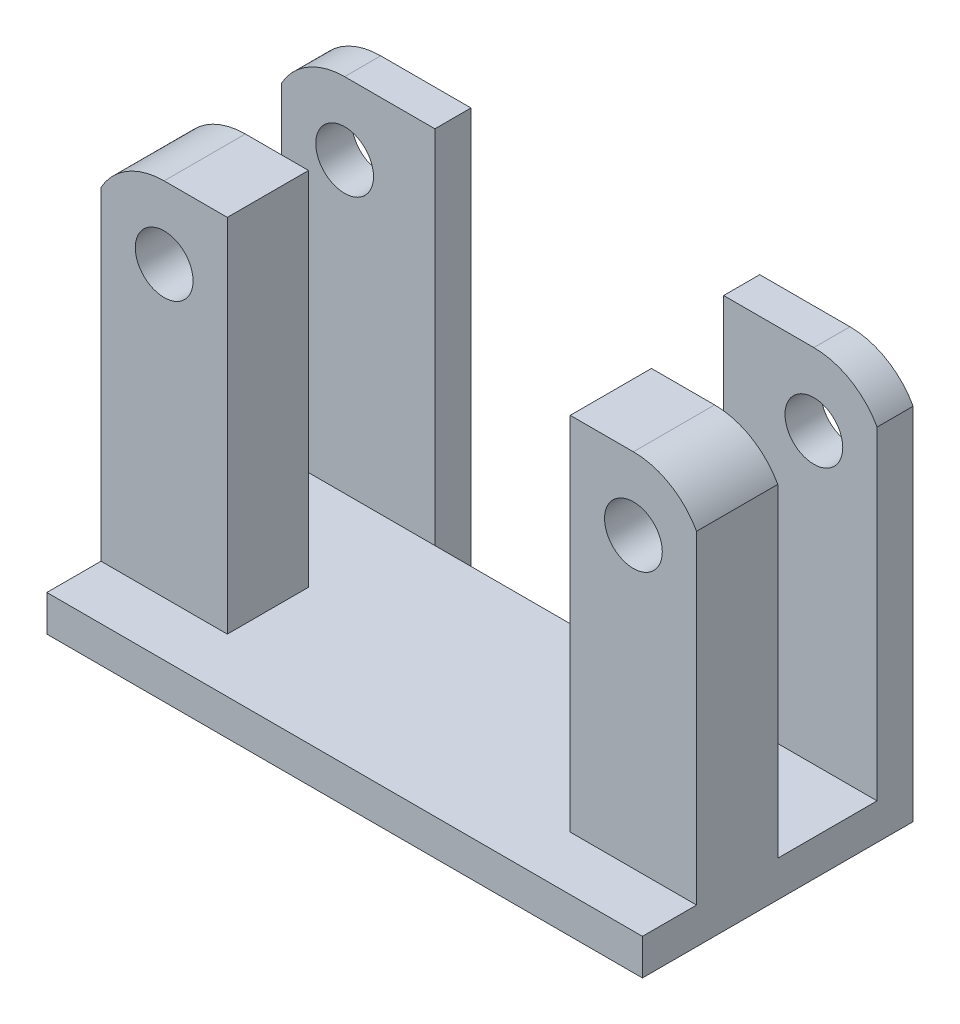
ISO-10303-21;
HEADER;
FILE_DESCRIPTION(('STEP AP214'),'2;1');
FILE_NAME('part.step','',(''),(''),'','','');
FILE_SCHEMA(('AUTOMOTIVE_DESIGN { 1 0 10303 214 1 1 1 1 }'));
ENDSEC;
DATA;
#1=APPLICATION_CONTEXT('core data for automotive mechanical design processes');
#2=APPLICATION_PROTOCOL_DEFINITION('international standard','automotive_design',2000,#1);
#3=PRODUCT_CONTEXT('',#1,'mechanical');
#4=PRODUCT('Part','Part','',(#3));
#5=PRODUCT_RELATED_PRODUCT_CATEGORY('part','',(#4));
#6=PRODUCT_DEFINITION_FORMATION('','',#4);
#7=PRODUCT_DEFINITION_CONTEXT('part definition',#1,'design');
#8=PRODUCT_DEFINITION('design','',#6,#7);
#9=PRODUCT_DEFINITION_SHAPE('','',#8);
#10=(LENGTH_UNIT() NAMED_UNIT(*) SI_UNIT(.MILLI.,.METRE.));
#11=(NAMED_UNIT(*) PLANE_ANGLE_UNIT() SI_UNIT($,.RADIAN.));
#12=(NAMED_UNIT(*) SI_UNIT($,.STERADIAN.) SOLID_ANGLE_UNIT());
#13=UNCERTAINTY_MEASURE_WITH_UNIT(LENGTH_MEASURE(1.E-05),#10,'distance_accuracy_value','');
#14=(GEOMETRIC_REPRESENTATION_CONTEXT(3) GLOBAL_UNCERTAINTY_ASSIGNED_CONTEXT((#13)) GLOBAL_UNIT_ASSIGNED_CONTEXT((#10,
#11,#12)) REPRESENTATION_CONTEXT('',''));
#15=CARTESIAN_POINT('',(0.,0.,0.));
#16=DIRECTION('',(0.,0.,1.));
#17=DIRECTION('',(1.,0.,0.));
#18=AXIS2_PLACEMENT_3D('',#15,#16,#17);
#19=CARTESIAN_POINT('',(-13.7362439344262,-2.,0.));
#20=DIRECTION('',(-1.,0.,0.));
#21=DIRECTION('',(0.,0.,1.));
#22=AXIS2_PLACEMENT_3D('',#19,#20,#21);
#23=PLANE('',#22);
#24=DIRECTION('',(0.,0.,1.));
#25=VECTOR('',#24,1.);
#26=CARTESIAN_POINT('',(-13.7362439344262,17.9364916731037,-29.7142886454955));
#27=LINE('',#26,#25);
#28=CARTESIAN_POINT('',(-13.7362439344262,17.9364916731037,-17.6888052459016));
#29=VERTEX_POINT('',#28);
#30=CARTESIAN_POINT('',(-13.7362439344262,17.9364916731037,-13.1888052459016));
#31=VERTEX_POINT('',#30);
#32=EDGE_CURVE('E201',#29,#31,#27,.T.);
#33=ORIENTED_EDGE('',*,*,#32,.T.);
#34=DIRECTION('',(0.,-1.,0.));
#35=VECTOR('',#34,1.);
#36=CARTESIAN_POINT('',(-13.7362439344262,20.,-13.1888052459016));
#37=LINE('',#36,#35);
#38=CARTESIAN_POINT('',(-13.7362439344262,0.,-13.1888052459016));
#39=VERTEX_POINT('',#38);
#40=EDGE_CURVE('E329',#31,#39,#37,.T.);
#41=ORIENTED_EDGE('',*,*,#40,.T.);
#42=DIRECTION('',(0.,0.,1.));
#43=VECTOR('',#42,1.);
#44=CARTESIAN_POINT('',(-13.7362439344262,0.,0.));
#45=LINE('',#44,#43);
#46=CARTESIAN_POINT('',(-13.7362439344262,0.,-10.1888052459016));
#47=VERTEX_POINT('',#46);
#48=EDGE_CURVE('E254',#39,#47,#45,.T.);
#49=ORIENTED_EDGE('',*,*,#48,.T.);
#50=DIRECTION('',(0.,1.,0.));
#51=VECTOR('',#50,1.);
#52=CARTESIAN_POINT('',(-13.7362439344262,-2.,-10.1888052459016));
#53=LINE('',#52,#51);
#54=CARTESIAN_POINT('',(-13.7362439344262,-2.,-10.1888052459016));
#55=VERTEX_POINT('',#54);
#56=EDGE_CURVE('E45',#55,#47,#53,.T.);
#57=ORIENTED_EDGE('',*,*,#56,.F.);
#58=DIRECTION('',(0.,0.,1.));
#59=VECTOR('',#58,1.);
#60=CARTESIAN_POINT('',(-13.7362439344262,-2.,0.));
#61=LINE('',#60,#59);
#62=CARTESIAN_POINT('',(-13.7362439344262,-2.,-25.1888052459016));
#63=VERTEX_POINT('',#62);
#64=EDGE_CURVE('E217',#63,#55,#61,.T.);
#65=ORIENTED_EDGE('',*,*,#64,.F.);
#66=DIRECTION('',(0.,1.,0.));
#67=VECTOR('',#66,1.);
#68=CARTESIAN_POINT('',(-13.7362439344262,-2.,-25.1888052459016));
#69=LINE('',#68,#67);
#70=CARTESIAN_POINT('',(-13.7362439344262,17.9364916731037,-25.1888052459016));
#71=VERTEX_POINT('',#70);
#72=EDGE_CURVE('E208',#63,#71,#69,.T.);
#73=ORIENTED_EDGE('',*,*,#72,.T.);
#74=CARTESIAN_POINT('',(-13.7362439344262,17.9364916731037,-23.1888052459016));
#75=VERTEX_POINT('',#74);
#76=EDGE_CURVE('E190',#71,#75,#27,.T.);
#77=ORIENTED_EDGE('',*,*,#76,.T.);
#78=DIRECTION('',(0.,-1.,0.));
#79=VECTOR('',#78,1.);
#80=CARTESIAN_POINT('',(-13.7362439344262,20.,-23.1888052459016));
#81=LINE('',#80,#79);
#82=CARTESIAN_POINT('',(-13.7362439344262,0.,-23.1888052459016));
#83=VERTEX_POINT('',#82);
#84=EDGE_CURVE('E313',#75,#83,#81,.T.);
#85=ORIENTED_EDGE('',*,*,#84,.T.);
#86=CARTESIAN_POINT('',(-13.7362439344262,0.,-17.6888052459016));
#87=VERTEX_POINT('',#86);
#88=EDGE_CURVE('E252',#83,#87,#45,.T.);
#89=ORIENTED_EDGE('',*,*,#88,.T.);
#90=DIRECTION('',(0.,-1.,0.));
#91=VECTOR('',#90,1.);
#92=CARTESIAN_POINT('',(-13.7362439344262,20.,-17.6888052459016));
#93=LINE('',#92,#91);
#94=EDGE_CURVE('E331',#29,#87,#93,.T.);
#95=ORIENTED_EDGE('',*,*,#94,.F.);
#96=EDGE_LOOP('',(#33,#41,#49,#57,#65,#73,#77,#85,#89,#95));
#97=FACE_BOUND('',#96,.T.);
#98=ADVANCED_FACE('F37',(#97),#23,.F.);
#99=CARTESIAN_POINT('',(-46.7362439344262,-2.,0.));
#100=DIRECTION('',(-1.,0.,0.));
#101=DIRECTION('',(0.,0.,1.));
#102=AXIS2_PLACEMENT_3D('',#99,#100,#101);
#103=PLANE('',#102);
#104=DIRECTION('',(0.,-1.,0.));
#105=VECTOR('',#104,1.);
#106=CARTESIAN_POINT('',(-46.7362439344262,20.,-13.1888052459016));
#107=LINE('',#106,#105);
#108=CARTESIAN_POINT('',(-46.7362439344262,17.9364916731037,-13.1888052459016));
#109=VERTEX_POINT('',#108);
#110=CARTESIAN_POINT('',(-46.7362439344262,0.,-13.1888052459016));
#111=VERTEX_POINT('',#110);
#112=EDGE_CURVE('E275',#109,#111,#107,.T.);
#113=ORIENTED_EDGE('',*,*,#112,.F.);
#114=DIRECTION('',(0.,0.,1.));
#115=VECTOR('',#114,1.);
#116=CARTESIAN_POINT('',(-46.7362439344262,17.9364916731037,-29.7142886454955));
#117=LINE('',#116,#115);
#118=CARTESIAN_POINT('',(-46.7362439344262,17.9364916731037,-17.6888052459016));
#119=VERTEX_POINT('',#118);
#120=EDGE_CURVE('E368',#119,#109,#117,.T.);
#121=ORIENTED_EDGE('',*,*,#120,.F.);
#122=DIRECTION('',(0.,-1.,0.));
#123=VECTOR('',#122,1.);
#124=CARTESIAN_POINT('',(-46.7362439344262,20.,-17.6888052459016));
#125=LINE('',#124,#123);
#126=CARTESIAN_POINT('',(-46.7362439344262,0.,-17.6888052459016));
#127=VERTEX_POINT('',#126);
#128=EDGE_CURVE('E273',#119,#127,#125,.T.);
#129=ORIENTED_EDGE('',*,*,#128,.T.);
#130=DIRECTION('',(0.,0.,1.));
#131=VECTOR('',#130,1.);
#132=CARTESIAN_POINT('',(-46.7362439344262,0.,0.));
#133=LINE('',#132,#131);
#134=CARTESIAN_POINT('',(-46.7362439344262,0.,-23.1888052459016));
#135=VERTEX_POINT('',#134);
#136=EDGE_CURVE('E245',#135,#127,#133,.T.);
#137=ORIENTED_EDGE('',*,*,#136,.F.);
#138=DIRECTION('',(0.,-1.,0.));
#139=VECTOR('',#138,1.);
#140=CARTESIAN_POINT('',(-46.7362439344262,20.,-23.1888052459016));
#141=LINE('',#140,#139);
#142=CARTESIAN_POINT('',(-46.7362439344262,17.9364916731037,-23.1888052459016));
#143=VERTEX_POINT('',#142);
#144=EDGE_CURVE('E298',#143,#135,#141,.T.);
#145=ORIENTED_EDGE('',*,*,#144,.F.);
#146=CARTESIAN_POINT('',(-46.7362439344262,17.9364916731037,-25.1888052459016));
#147=VERTEX_POINT('',#146);
#148=EDGE_CURVE('E370',#147,#143,#117,.T.);
#149=ORIENTED_EDGE('',*,*,#148,.F.);
#150=DIRECTION('',(0.,1.,0.));
#151=VECTOR('',#150,1.);
#152=CARTESIAN_POINT('',(-46.7362439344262,-2.,-25.1888052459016));
#153=LINE('',#152,#151);
#154=CARTESIAN_POINT('',(-46.7362439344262,-2.,-25.1888052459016));
#155=VERTEX_POINT('',#154);
#156=EDGE_CURVE('E234',#155,#147,#153,.T.);
#157=ORIENTED_EDGE('',*,*,#156,.F.);
#158=DIRECTION('',(0.,0.,1.));
#159=VECTOR('',#158,1.);
#160=CARTESIAN_POINT('',(-46.7362439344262,-2.,0.));
#161=LINE('',#160,#159);
#162=CARTESIAN_POINT('',(-46.7362439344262,-2.,-10.1888052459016));
#163=VERTEX_POINT('',#162);
#164=EDGE_CURVE('E224',#155,#163,#161,.T.);
#165=ORIENTED_EDGE('',*,*,#164,.T.);
#166=DIRECTION('',(0.,1.,0.));
#167=VECTOR('',#166,1.);
#168=CARTESIAN_POINT('',(-46.7362439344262,-2.,-10.1888052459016));
#169=LINE('',#168,#167);
#170=CARTESIAN_POINT('',(-46.7362439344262,0.,-10.1888052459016));
#171=VERTEX_POINT('',#170);
#172=EDGE_CURVE('E237',#163,#171,#169,.T.);
#173=ORIENTED_EDGE('',*,*,#172,.T.);
#174=EDGE_CURVE('E248',#111,#171,#133,.T.);
#175=ORIENTED_EDGE('',*,*,#174,.F.);
#176=EDGE_LOOP('',(#113,#121,#129,#137,#145,#149,#157,#165,#173,#175));
#177=FACE_BOUND('',#176,.T.);
#178=ADVANCED_FACE('F403',(#177),#103,.T.);
#179=CARTESIAN_POINT('',(0.,-2.,-25.1888052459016));
#180=DIRECTION('',(0.,0.,1.));
#181=DIRECTION('',(1.,0.,0.));
#182=AXIS2_PLACEMENT_3D('',#179,#180,#181);
#183=PLANE('',#182);
#184=CARTESIAN_POINT('',(-43.2362439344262,16.,-25.1888052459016));
#185=DIRECTION('',(0.,0.,1.));
#186=DIRECTION('',(1.,0.,0.));
#187=AXIS2_PLACEMENT_3D('',#184,#185,#186);
#188=CIRCLE('',#187,1.6);
#189=CARTESIAN_POINT('',(-41.6362439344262,16.,-25.1888052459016));
#190=VERTEX_POINT('',#189);
#191=EDGE_CURVE('E377',#190,#190,#188,.F.);
#192=ORIENTED_EDGE('',*,*,#191,.F.);
#193=EDGE_LOOP('',(#192));
#194=FACE_BOUND('',#193,.T.);
#195=CARTESIAN_POINT('',(-43.2362439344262,16.,-25.1888052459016));
#196=DIRECTION('',(0.,0.,1.));
#197=DIRECTION('',(1.,0.,0.));
#198=AXIS2_PLACEMENT_3D('',#195,#196,#197);
#199=CIRCLE('',#198,4.);
#200=CARTESIAN_POINT('',(-43.2362439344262,20.,-25.1888052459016));
#201=VERTEX_POINT('',#200);
#202=EDGE_CURVE('E365',#147,#201,#199,.F.);
#203=ORIENTED_EDGE('',*,*,#202,.T.);
#204=DIRECTION('',(1.,0.,0.));
#205=VECTOR('',#204,1.);
#206=CARTESIAN_POINT('',(0.,20.,-25.1888052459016));
#207=LINE('',#206,#205);
#208=CARTESIAN_POINT('',(-38.2362439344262,20.,-25.1888052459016));
#209=VERTEX_POINT('',#208);
#210=EDGE_CURVE('E300',#201,#209,#207,.T.);
#211=ORIENTED_EDGE('',*,*,#210,.T.);
#212=DIRECTION('',(0.,1.,0.));
#213=VECTOR('',#212,1.);
#214=CARTESIAN_POINT('',(-38.2362439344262,-2.,-25.1888052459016));
#215=LINE('',#214,#213);
#216=CARTESIAN_POINT('',(-38.2362439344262,-2.,-25.1888052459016));
#217=VERTEX_POINT('',#216);
#218=EDGE_CURVE('E231',#217,#209,#215,.T.);
#219=ORIENTED_EDGE('',*,*,#218,.F.);
#220=DIRECTION('',(1.,0.,0.));
#221=VECTOR('',#220,1.);
#222=CARTESIAN_POINT('',(0.,-2.,-25.1888052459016));
#223=LINE('',#222,#221);
#224=EDGE_CURVE('E258',#155,#217,#223,.T.);
#225=ORIENTED_EDGE('',*,*,#224,.F.);
#226=ORIENTED_EDGE('',*,*,#156,.T.);
#227=EDGE_LOOP('',(#203,#211,#219,#225,#226));
#228=FACE_BOUND('',#227,.T.);
#229=ADVANCED_FACE('F395',(#194,#228),#183,.F.);
#230=CARTESIAN_POINT('',(0.,-2.,-25.1888052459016));
#231=DIRECTION('',(0.,0.,1.));
#232=DIRECTION('',(1.,0.,0.));
#233=AXIS2_PLACEMENT_3D('',#230,#231,#232);
#234=PLANE('',#233);
#235=CARTESIAN_POINT('',(-17.2362439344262,16.,-25.1888052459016));
#236=DIRECTION('',(0.,0.,1.));
#237=DIRECTION('',(1.,0.,0.));
#238=AXIS2_PLACEMENT_3D('',#235,#236,#237);
#239=CIRCLE('',#238,1.6);
#240=CARTESIAN_POINT('',(-15.6362439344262,16.,-25.1888052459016));
#241=VERTEX_POINT('',#240);
#242=EDGE_CURVE('E386',#241,#241,#239,.F.);
#243=ORIENTED_EDGE('',*,*,#242,.F.);
#244=EDGE_LOOP('',(#243));
#245=FACE_BOUND('',#244,.T.);
#246=CARTESIAN_POINT('',(-17.2362439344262,16.,-25.1888052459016));
#247=DIRECTION('',(0.,0.,1.));
#248=DIRECTION('',(1.,0.,0.));
#249=AXIS2_PLACEMENT_3D('',#246,#247,#248);
#250=CIRCLE('',#249,4.);
#251=CARTESIAN_POINT('',(-17.2362439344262,20.,-25.1888052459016));
#252=VERTEX_POINT('',#251);
#253=EDGE_CURVE('E193',#252,#71,#250,.F.);
#254=ORIENTED_EDGE('',*,*,#253,.T.);
#255=ORIENTED_EDGE('',*,*,#72,.F.);
#256=DIRECTION('',(1.,0.,0.));
#257=VECTOR('',#256,1.);
#258=CARTESIAN_POINT('',(0.,-2.,-25.1888052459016));
#259=LINE('',#258,#257);
#260=CARTESIAN_POINT('',(-22.2362439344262,-2.,-25.1888052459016));
#261=VERTEX_POINT('',#260);
#262=EDGE_CURVE('E267',#261,#63,#259,.T.);
#263=ORIENTED_EDGE('',*,*,#262,.F.);
#264=DIRECTION('',(0.,1.,0.));
#265=VECTOR('',#264,1.);
#266=CARTESIAN_POINT('',(-22.2362439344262,-2.,-25.1888052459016));
#267=LINE('',#266,#265);
#268=CARTESIAN_POINT('',(-22.2362439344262,20.,-25.1888052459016));
#269=VERTEX_POINT('',#268);
#270=EDGE_CURVE('E218',#261,#269,#267,.T.);
#271=ORIENTED_EDGE('',*,*,#270,.T.);
#272=DIRECTION('',(1.,0.,0.));
#273=VECTOR('',#272,1.);
#274=CARTESIAN_POINT('',(0.,20.,-25.1888052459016));
#275=LINE('',#274,#273);
#276=EDGE_CURVE('E211',#269,#252,#275,.T.);
#277=ORIENTED_EDGE('',*,*,#276,.T.);
#278=EDGE_LOOP('',(#254,#255,#263,#271,#277));
#279=FACE_BOUND('',#278,.T.);
#280=ADVANCED_FACE('F206',(#245,#279),#234,.F.);
#281=CARTESIAN_POINT('',(0.,20.,-17.6888052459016));
#282=DIRECTION('',(0.,0.,-1.));
#283=DIRECTION('',(-1.,0.,0.));
#284=AXIS2_PLACEMENT_3D('',#281,#282,#283);
#285=PLANE('',#284);
#286=CARTESIAN_POINT('',(-43.2362439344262,16.,-17.6888052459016));
#287=DIRECTION('',(0.,0.,-1.));
#288=DIRECTION('',(-1.,0.,0.));
#289=AXIS2_PLACEMENT_3D('',#286,#287,#288);
#290=CIRCLE('',#289,1.6);
#291=CARTESIAN_POINT('',(-44.8362439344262,16.,-17.6888052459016));
#292=VERTEX_POINT('',#291);
#293=EDGE_CURVE('E344',#292,#292,#290,.T.);
#294=ORIENTED_EDGE('',*,*,#293,.F.);
#295=EDGE_LOOP('',(#294));
#296=FACE_BOUND('',#295,.T.);
#297=ORIENTED_EDGE('',*,*,#128,.F.);
#298=CARTESIAN_POINT('',(-43.2362439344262,16.,-17.6888052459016));
#299=DIRECTION('',(0.,0.,-1.));
#300=DIRECTION('',(-1.,0.,0.));
#301=AXIS2_PLACEMENT_3D('',#298,#299,#300);
#302=CIRCLE('',#301,4.);
#303=CARTESIAN_POINT('',(-43.2362439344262,20.,-17.6888052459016));
#304=VERTEX_POINT('',#303);
#305=EDGE_CURVE('E352',#119,#304,#302,.T.);
#306=ORIENTED_EDGE('',*,*,#305,.T.);
#307=DIRECTION('',(1.,0.,0.));
#308=VECTOR('',#307,1.);
#309=CARTESIAN_POINT('',(0.,20.,-17.6888052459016));
#310=LINE('',#309,#308);
#311=CARTESIAN_POINT('',(-39.7362439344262,20.,-17.6888052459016));
#312=VERTEX_POINT('',#311);
#313=EDGE_CURVE('E292',#304,#312,#310,.T.);
#314=ORIENTED_EDGE('',*,*,#313,.T.);
#315=DIRECTION('',(0.,-1.,0.));
#316=VECTOR('',#315,1.);
#317=CARTESIAN_POINT('',(-39.7362439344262,20.,-17.6888052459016));
#318=LINE('',#317,#316);
#319=CARTESIAN_POINT('',(-39.7362439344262,0.,-17.6888052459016));
#320=VERTEX_POINT('',#319);
#321=EDGE_CURVE('E270',#312,#320,#318,.T.);
#322=ORIENTED_EDGE('',*,*,#321,.T.);
#323=DIRECTION('',(1.,0.,0.));
#324=VECTOR('',#323,1.);
#325=CARTESIAN_POINT('',(0.,0.,-17.6888052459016));
#326=LINE('',#325,#324);
#327=EDGE_CURVE('E284',#127,#320,#326,.T.);
#328=ORIENTED_EDGE('',*,*,#327,.F.);
#329=EDGE_LOOP('',(#297,#306,#314,#322,#328));
#330=FACE_BOUND('',#329,.T.);
#331=ADVANCED_FACE('F394',(#296,#330),#285,.T.);
#332=CARTESIAN_POINT('',(0.,20.,-13.1888052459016));
#333=DIRECTION('',(0.,0.,-1.));
#334=DIRECTION('',(-1.,0.,0.));
#335=AXIS2_PLACEMENT_3D('',#332,#333,#334);
#336=PLANE('',#335);
#337=CARTESIAN_POINT('',(-43.2362439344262,16.,-13.1888052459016));
#338=DIRECTION('',(0.,0.,1.));
#339=DIRECTION('',(1.,0.,0.));
#340=AXIS2_PLACEMENT_3D('',#337,#338,#339);
#341=CIRCLE('',#340,1.6);
#342=CARTESIAN_POINT('',(-41.6362439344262,16.,-13.1888052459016));
#343=VERTEX_POINT('',#342);
#344=EDGE_CURVE('E213',#343,#343,#341,.T.);
#345=ORIENTED_EDGE('',*,*,#344,.F.);
#346=EDGE_LOOP('',(#345));
#347=FACE_BOUND('',#346,.T.);
#348=CARTESIAN_POINT('',(-43.2362439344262,16.,-13.1888052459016));
#349=DIRECTION('',(0.,0.,1.));
#350=DIRECTION('',(1.,0.,0.));
#351=AXIS2_PLACEMENT_3D('',#348,#349,#350);
#352=CIRCLE('',#351,4.);
#353=CARTESIAN_POINT('',(-43.2362439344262,20.,-13.1888052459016));
#354=VERTEX_POINT('',#353);
#355=EDGE_CURVE('E52',#354,#109,#352,.T.);
#356=ORIENTED_EDGE('',*,*,#355,.T.);
#357=ORIENTED_EDGE('',*,*,#112,.T.);
#358=DIRECTION('',(1.,0.,0.));
#359=VECTOR('',#358,1.);
#360=CARTESIAN_POINT('',(0.,0.,-13.1888052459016));
#361=LINE('',#360,#359);
#362=CARTESIAN_POINT('',(-39.7362439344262,0.,-13.1888052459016));
#363=VERTEX_POINT('',#362);
#364=EDGE_CURVE('E280',#111,#363,#361,.T.);
#365=ORIENTED_EDGE('',*,*,#364,.T.);
#366=DIRECTION('',(0.,-1.,0.));
#367=VECTOR('',#366,1.);
#368=CARTESIAN_POINT('',(-39.7362439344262,20.,-13.1888052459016));
#369=LINE('',#368,#367);
#370=CARTESIAN_POINT('',(-39.7362439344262,20.,-13.1888052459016));
#371=VERTEX_POINT('',#370);
#372=EDGE_CURVE('E277',#371,#363,#369,.T.);
#373=ORIENTED_EDGE('',*,*,#372,.F.);
#374=DIRECTION('',(1.,0.,0.));
#375=VECTOR('',#374,1.);
#376=CARTESIAN_POINT('',(0.,20.,-13.1888052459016));
#377=LINE('',#376,#375);
#378=EDGE_CURVE('E279',#354,#371,#377,.T.);
#379=ORIENTED_EDGE('',*,*,#378,.F.);
#380=EDGE_LOOP('',(#356,#357,#365,#373,#379));
#381=FACE_BOUND('',#380,.T.);
#382=ADVANCED_FACE('F400',(#347,#381),#336,.F.);
#383=CARTESIAN_POINT('',(0.,20.,0.));
#384=DIRECTION('',(0.,1.,0.));
#385=DIRECTION('',(0.,0.,1.));
#386=AXIS2_PLACEMENT_3D('',#383,#384,#385);
#387=PLANE('',#386);
#388=ORIENTED_EDGE('',*,*,#313,.F.);
#389=DIRECTION('',(0.,0.,1.));
#390=VECTOR('',#389,1.);
#391=CARTESIAN_POINT('',(-43.2362439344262,20.,-29.7142886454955));
#392=LINE('',#391,#390);
#393=EDGE_CURVE('E369',#304,#354,#392,.T.);
#394=ORIENTED_EDGE('',*,*,#393,.T.);
#395=ORIENTED_EDGE('',*,*,#378,.T.);
#396=DIRECTION('',(0.,0.,1.));
#397=VECTOR('',#396,1.);
#398=CARTESIAN_POINT('',(-39.7362439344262,20.,0.));
#399=LINE('',#398,#397);
#400=EDGE_CURVE('E283',#312,#371,#399,.T.);
#401=ORIENTED_EDGE('',*,*,#400,.F.);
#402=EDGE_LOOP('',(#388,#394,#395,#401));
#403=FACE_BOUND('',#402,.T.);
#404=ADVANCED_FACE('F467',(#403),#387,.T.);
#405=CARTESIAN_POINT('',(0.,20.,-23.1888052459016));
#406=DIRECTION('',(0.,0.,1.));
#407=DIRECTION('',(1.,0.,0.));
#408=AXIS2_PLACEMENT_3D('',#405,#406,#407);
#409=PLANE('',#408);
#410=CARTESIAN_POINT('',(-43.2362439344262,16.,-23.1888052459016));
#411=DIRECTION('',(0.,0.,1.));
#412=DIRECTION('',(1.,0.,0.));
#413=AXIS2_PLACEMENT_3D('',#410,#411,#412);
#414=CIRCLE('',#413,1.6);
#415=CARTESIAN_POINT('',(-41.6362439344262,16.,-23.1888052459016));
#416=VERTEX_POINT('',#415);
#417=EDGE_CURVE('E40',#416,#416,#414,.T.);
#418=ORIENTED_EDGE('',*,*,#417,.F.);
#419=EDGE_LOOP('',(#418));
#420=FACE_BOUND('',#419,.T.);
#421=DIRECTION('',(-1.,0.,0.));
#422=VECTOR('',#421,1.);
#423=CARTESIAN_POINT('',(0.,20.,-23.1888052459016));
#424=LINE('',#423,#422);
#425=CARTESIAN_POINT('',(-38.2362439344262,20.,-23.1888052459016));
#426=VERTEX_POINT('',#425);
#427=CARTESIAN_POINT('',(-43.2362439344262,20.,-23.1888052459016));
#428=VERTEX_POINT('',#427);
#429=EDGE_CURVE('E304',#426,#428,#424,.T.);
#430=ORIENTED_EDGE('',*,*,#429,.T.);
#431=CARTESIAN_POINT('',(-43.2362439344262,16.,-23.1888052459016));
#432=DIRECTION('',(0.,0.,1.));
#433=DIRECTION('',(1.,0.,0.));
#434=AXIS2_PLACEMENT_3D('',#431,#432,#433);
#435=CIRCLE('',#434,4.);
#436=EDGE_CURVE('E60',#428,#143,#435,.T.);
#437=ORIENTED_EDGE('',*,*,#436,.T.);
#438=ORIENTED_EDGE('',*,*,#144,.T.);
#439=DIRECTION('',(-1.,0.,0.));
#440=VECTOR('',#439,1.);
#441=CARTESIAN_POINT('',(0.,0.,-23.1888052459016));
#442=LINE('',#441,#440);
#443=CARTESIAN_POINT('',(-38.2362439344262,0.,-23.1888052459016));
#444=VERTEX_POINT('',#443);
#445=EDGE_CURVE('E301',#444,#135,#442,.T.);
#446=ORIENTED_EDGE('',*,*,#445,.F.);
#447=DIRECTION('',(0.,-1.,0.));
#448=VECTOR('',#447,1.);
#449=CARTESIAN_POINT('',(-38.2362439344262,20.,-23.1888052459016));
#450=LINE('',#449,#448);
#451=EDGE_CURVE('E290',#426,#444,#450,.T.);
#452=ORIENTED_EDGE('',*,*,#451,.F.);
#453=EDGE_LOOP('',(#430,#437,#438,#446,#452));
#454=FACE_BOUND('',#453,.T.);
#455=ADVANCED_FACE('F454',(#420,#454),#409,.T.);
#456=CARTESIAN_POINT('',(0.,20.,0.));
#457=DIRECTION('',(0.,1.,0.));
#458=DIRECTION('',(0.,0.,1.));
#459=AXIS2_PLACEMENT_3D('',#456,#457,#458);
#460=PLANE('',#459);
#461=ORIENTED_EDGE('',*,*,#210,.F.);
#462=EDGE_CURVE('E366',#201,#428,#392,.T.);
#463=ORIENTED_EDGE('',*,*,#462,.T.);
#464=ORIENTED_EDGE('',*,*,#429,.F.);
#465=DIRECTION('',(0.,0.,1.));
#466=VECTOR('',#465,1.);
#467=CARTESIAN_POINT('',(-38.2362439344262,20.,0.));
#468=LINE('',#467,#466);
#469=EDGE_CURVE('E307',#209,#426,#468,.T.);
#470=ORIENTED_EDGE('',*,*,#469,.F.);
#471=EDGE_LOOP('',(#461,#463,#464,#470));
#472=FACE_BOUND('',#471,.T.);
#473=ADVANCED_FACE('F500',(#472),#460,.T.);
#474=CARTESIAN_POINT('',(0.,20.,-23.1888052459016));
#475=DIRECTION('',(0.,0.,-1.));
#476=DIRECTION('',(-1.,0.,0.));
#477=AXIS2_PLACEMENT_3D('',#474,#475,#476);
#478=PLANE('',#477);
#479=CARTESIAN_POINT('',(-17.2362439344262,16.,-23.1888052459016));
#480=DIRECTION('',(0.,0.,-1.));
#481=DIRECTION('',(-1.,0.,0.));
#482=AXIS2_PLACEMENT_3D('',#479,#480,#481);
#483=CIRCLE('',#482,1.6);
#484=CARTESIAN_POINT('',(-18.8362439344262,16.,-23.1888052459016));
#485=VERTEX_POINT('',#484);
#486=EDGE_CURVE('E356',#485,#485,#483,.T.);
#487=ORIENTED_EDGE('',*,*,#486,.T.);
#488=EDGE_LOOP('',(#487));
#489=FACE_BOUND('',#488,.T.);
#490=CARTESIAN_POINT('',(-17.2362439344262,16.,-23.1888052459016));
#491=DIRECTION('',(0.,0.,-1.));
#492=DIRECTION('',(-1.,0.,0.));
#493=AXIS2_PLACEMENT_3D('',#490,#491,#492);
#494=CIRCLE('',#493,4.);
#495=CARTESIAN_POINT('',(-17.2362439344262,20.,-23.1888052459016));
#496=VERTEX_POINT('',#495);
#497=EDGE_CURVE('E196',#496,#75,#494,.T.);
#498=ORIENTED_EDGE('',*,*,#497,.F.);
#499=DIRECTION('',(1.,0.,0.));
#500=VECTOR('',#499,1.);
#501=CARTESIAN_POINT('',(0.,20.,-23.1888052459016));
#502=LINE('',#501,#500);
#503=CARTESIAN_POINT('',(-22.2362439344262,20.,-23.1888052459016));
#504=VERTEX_POINT('',#503);
#505=EDGE_CURVE('E321',#504,#496,#502,.T.);
#506=ORIENTED_EDGE('',*,*,#505,.F.);
#507=DIRECTION('',(0.,-1.,0.));
#508=VECTOR('',#507,1.);
#509=CARTESIAN_POINT('',(-22.2362439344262,20.,-23.1888052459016));
#510=LINE('',#509,#508);
#511=CARTESIAN_POINT('',(-22.2362439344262,0.,-23.1888052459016));
#512=VERTEX_POINT('',#511);
#513=EDGE_CURVE('E305',#504,#512,#510,.T.);
#514=ORIENTED_EDGE('',*,*,#513,.T.);
#515=DIRECTION('',(1.,0.,0.));
#516=VECTOR('',#515,1.);
#517=CARTESIAN_POINT('',(0.,0.,-23.1888052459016));
#518=LINE('',#517,#516);
#519=EDGE_CURVE('E315',#512,#83,#518,.T.);
#520=ORIENTED_EDGE('',*,*,#519,.T.);
#521=ORIENTED_EDGE('',*,*,#84,.F.);
#522=EDGE_LOOP('',(#498,#506,#514,#520,#521));
#523=FACE_BOUND('',#522,.T.);
#524=ADVANCED_FACE('F492',(#489,#523),#478,.F.);
#525=CARTESIAN_POINT('',(0.,20.,-17.6888052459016));
#526=DIRECTION('',(0.,0.,1.));
#527=DIRECTION('',(1.,0.,0.));
#528=AXIS2_PLACEMENT_3D('',#525,#526,#527);
#529=PLANE('',#528);
#530=CARTESIAN_POINT('',(-17.2362439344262,16.,-17.6888052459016));
#531=DIRECTION('',(0.,0.,1.));
#532=DIRECTION('',(1.,0.,0.));
#533=AXIS2_PLACEMENT_3D('',#530,#531,#532);
#534=CIRCLE('',#533,1.6);
#535=CARTESIAN_POINT('',(-15.6362439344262,16.,-17.6888052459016));
#536=VERTEX_POINT('',#535);
#537=EDGE_CURVE('E359',#536,#536,#534,.T.);
#538=ORIENTED_EDGE('',*,*,#537,.T.);
#539=EDGE_LOOP('',(#538));
#540=FACE_BOUND('',#539,.T.);
#541=CARTESIAN_POINT('',(-17.2362439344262,16.,-17.6888052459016));
#542=DIRECTION('',(0.,0.,1.));
#543=DIRECTION('',(1.,0.,0.));
#544=AXIS2_PLACEMENT_3D('',#541,#542,#543);
#545=CIRCLE('',#544,4.);
#546=CARTESIAN_POINT('',(-17.2362439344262,20.,-17.6888052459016));
#547=VERTEX_POINT('',#546);
#548=EDGE_CURVE('E363',#29,#547,#545,.T.);
#549=ORIENTED_EDGE('',*,*,#548,.F.);
#550=ORIENTED_EDGE('',*,*,#94,.T.);
#551=DIRECTION('',(-1.,0.,0.));
#552=VECTOR('',#551,1.);
#553=CARTESIAN_POINT('',(0.,0.,-17.6888052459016));
#554=LINE('',#553,#552);
#555=CARTESIAN_POINT('',(-20.7362439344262,0.,-17.6888052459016));
#556=VERTEX_POINT('',#555);
#557=EDGE_CURVE('E341',#87,#556,#554,.T.);
#558=ORIENTED_EDGE('',*,*,#557,.T.);
#559=DIRECTION('',(0.,-1.,0.));
#560=VECTOR('',#559,1.);
#561=CARTESIAN_POINT('',(-20.7362439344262,20.,-17.6888052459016));
#562=LINE('',#561,#560);
#563=CARTESIAN_POINT('',(-20.7362439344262,20.,-17.6888052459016));
#564=VERTEX_POINT('',#563);
#565=EDGE_CURVE('E319',#564,#556,#562,.T.);
#566=ORIENTED_EDGE('',*,*,#565,.F.);
#567=DIRECTION('',(-1.,0.,0.));
#568=VECTOR('',#567,1.);
#569=CARTESIAN_POINT('',(0.,20.,-17.6888052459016));
#570=LINE('',#569,#568);
#571=EDGE_CURVE('E337',#547,#564,#570,.T.);
#572=ORIENTED_EDGE('',*,*,#571,.F.);
#573=EDGE_LOOP('',(#549,#550,#558,#566,#572));
#574=FACE_BOUND('',#573,.T.);
#575=ADVANCED_FACE('F541',(#540,#574),#529,.F.);
#576=CARTESIAN_POINT('',(0.,20.,-13.1888052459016));
#577=DIRECTION('',(0.,0.,1.));
#578=DIRECTION('',(1.,0.,0.));
#579=AXIS2_PLACEMENT_3D('',#576,#577,#578);
#580=PLANE('',#579);
#581=CARTESIAN_POINT('',(-17.2362439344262,16.,-13.1888052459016));
#582=DIRECTION('',(0.,0.,1.));
#583=DIRECTION('',(1.,0.,0.));
#584=AXIS2_PLACEMENT_3D('',#581,#582,#583);
#585=CIRCLE('',#584,1.6);
#586=CARTESIAN_POINT('',(-15.6362439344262,16.,-13.1888052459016));
#587=VERTEX_POINT('',#586);
#588=EDGE_CURVE('E379',#587,#587,#585,.T.);
#589=ORIENTED_EDGE('',*,*,#588,.F.);
#590=EDGE_LOOP('',(#589));
#591=FACE_BOUND('',#590,.T.);
#592=ORIENTED_EDGE('',*,*,#40,.F.);
#593=CARTESIAN_POINT('',(-17.2362439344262,16.,-13.1888052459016));
#594=DIRECTION('',(0.,0.,1.));
#595=DIRECTION('',(1.,0.,0.));
#596=AXIS2_PLACEMENT_3D('',#593,#594,#595);
#597=CIRCLE('',#596,4.);
#598=CARTESIAN_POINT('',(-17.2362439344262,20.,-13.1888052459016));
#599=VERTEX_POINT('',#598);
#600=EDGE_CURVE('E200',#31,#599,#597,.T.);
#601=ORIENTED_EDGE('',*,*,#600,.T.);
#602=DIRECTION('',(-1.,0.,0.));
#603=VECTOR('',#602,1.);
#604=CARTESIAN_POINT('',(0.,20.,-13.1888052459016));
#605=LINE('',#604,#603);
#606=CARTESIAN_POINT('',(-20.7362439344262,20.,-13.1888052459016));
#607=VERTEX_POINT('',#606);
#608=EDGE_CURVE('E333',#599,#607,#605,.T.);
#609=ORIENTED_EDGE('',*,*,#608,.T.);
#610=DIRECTION('',(0.,-1.,0.));
#611=VECTOR('',#610,1.);
#612=CARTESIAN_POINT('',(-20.7362439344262,20.,-13.1888052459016));
#613=LINE('',#612,#611);
#614=CARTESIAN_POINT('',(-20.7362439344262,0.,-13.1888052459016));
#615=VERTEX_POINT('',#614);
#616=EDGE_CURVE('E327',#607,#615,#613,.T.);
#617=ORIENTED_EDGE('',*,*,#616,.T.);
#618=DIRECTION('',(-1.,0.,0.));
#619=VECTOR('',#618,1.);
#620=CARTESIAN_POINT('',(0.,0.,-13.1888052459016));
#621=LINE('',#620,#619);
#622=EDGE_CURVE('E334',#39,#615,#621,.T.);
#623=ORIENTED_EDGE('',*,*,#622,.F.);
#624=EDGE_LOOP('',(#592,#601,#609,#617,#623));
#625=FACE_BOUND('',#624,.T.);
#626=ADVANCED_FACE('F482',(#591,#625),#580,.T.);
#627=CARTESIAN_POINT('',(0.,0.,0.));
#628=DIRECTION('',(0.,1.,0.));
#629=DIRECTION('',(0.,0.,1.));
#630=AXIS2_PLACEMENT_3D('',#627,#628,#629);
#631=PLANE('',#630);
#632=DIRECTION('',(0.,0.,1.));
#633=VECTOR('',#632,1.);
#634=CARTESIAN_POINT('',(-20.7362439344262,0.,0.));
#635=LINE('',#634,#633);
#636=EDGE_CURVE('E338',#556,#615,#635,.T.);
#637=ORIENTED_EDGE('',*,*,#636,.F.);
#638=ORIENTED_EDGE('',*,*,#557,.F.);
#639=ORIENTED_EDGE('',*,*,#88,.F.);
#640=ORIENTED_EDGE('',*,*,#519,.F.);
#641=DIRECTION('',(1.,0.,0.));
#642=VECTOR('',#641,1.);
#643=CARTESIAN_POINT('',(0.,0.,-23.1888052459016));
#644=LINE('',#643,#642);
#645=EDGE_CURVE('E249',#444,#512,#644,.T.);
#646=ORIENTED_EDGE('',*,*,#645,.F.);
#647=ORIENTED_EDGE('',*,*,#445,.T.);
#648=ORIENTED_EDGE('',*,*,#136,.T.);
#649=ORIENTED_EDGE('',*,*,#327,.T.);
#650=DIRECTION('',(0.,0.,1.));
#651=VECTOR('',#650,1.);
#652=CARTESIAN_POINT('',(-39.7362439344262,0.,0.));
#653=LINE('',#652,#651);
#654=EDGE_CURVE('E287',#320,#363,#653,.T.);
#655=ORIENTED_EDGE('',*,*,#654,.T.);
#656=ORIENTED_EDGE('',*,*,#364,.F.);
#657=ORIENTED_EDGE('',*,*,#174,.T.);
#658=DIRECTION('',(1.,0.,0.));
#659=VECTOR('',#658,1.);
#660=CARTESIAN_POINT('',(0.,0.,-10.1888052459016));
#661=LINE('',#660,#659);
#662=EDGE_CURVE('E242',#171,#47,#661,.T.);
#663=ORIENTED_EDGE('',*,*,#662,.T.);
#664=ORIENTED_EDGE('',*,*,#48,.F.);
#665=ORIENTED_EDGE('',*,*,#622,.T.);
#666=EDGE_LOOP('',(#637,#638,#639,#640,#646,#647,#648,#649,#655,#656,#657,#663,#664,#665));
#667=FACE_BOUND('',#666,.T.);
#668=ADVANCED_FACE('F447',(#667),#631,.T.);
#669=CARTESIAN_POINT('',(0.,-2.,-10.1888052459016));
#670=DIRECTION('',(0.,0.,1.));
#671=DIRECTION('',(1.,0.,0.));
#672=AXIS2_PLACEMENT_3D('',#669,#670,#671);
#673=PLANE('',#672);
#674=ORIENTED_EDGE('',*,*,#662,.F.);
#675=ORIENTED_EDGE('',*,*,#172,.F.);
#676=DIRECTION('',(1.,0.,0.));
#677=VECTOR('',#676,1.);
#678=CARTESIAN_POINT('',(0.,-2.,-10.1888052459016));
#679=LINE('',#678,#677);
#680=EDGE_CURVE('E219',#163,#55,#679,.T.);
#681=ORIENTED_EDGE('',*,*,#680,.T.);
#682=ORIENTED_EDGE('',*,*,#56,.T.);
#683=EDGE_LOOP('',(#674,#675,#681,#682));
#684=FACE_BOUND('',#683,.T.);
#685=ADVANCED_FACE('F417',(#684),#673,.T.);
#686=CARTESIAN_POINT('',(-38.2362439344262,-2.,0.));
#687=DIRECTION('',(-1.,0.,0.));
#688=DIRECTION('',(0.,0.,1.));
#689=AXIS2_PLACEMENT_3D('',#686,#687,#688);
#690=PLANE('',#689);
#691=ORIENTED_EDGE('',*,*,#218,.T.);
#692=ORIENTED_EDGE('',*,*,#469,.T.);
#693=ORIENTED_EDGE('',*,*,#451,.T.);
#694=DIRECTION('',(0.,1.,0.));
#695=VECTOR('',#694,1.);
#696=CARTESIAN_POINT('',(-38.2362439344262,-2.,-23.1888052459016));
#697=LINE('',#696,#695);
#698=CARTESIAN_POINT('',(-38.2362439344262,-2.,-23.1888052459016));
#699=VERTEX_POINT('',#698);
#700=EDGE_CURVE('E229',#699,#444,#697,.T.);
#701=ORIENTED_EDGE('',*,*,#700,.F.);
#702=DIRECTION('',(0.,0.,1.));
#703=VECTOR('',#702,1.);
#704=CARTESIAN_POINT('',(-38.2362439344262,-2.,0.));
#705=LINE('',#704,#703);
#706=EDGE_CURVE('E260',#217,#699,#705,.T.);
#707=ORIENTED_EDGE('',*,*,#706,.F.);
#708=EDGE_LOOP('',(#691,#692,#693,#701,#707));
#709=FACE_BOUND('',#708,.T.);
#710=ADVANCED_FACE('F420',(#709),#690,.F.);
#711=CARTESIAN_POINT('',(0.,-2.,-23.1888052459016));
#712=DIRECTION('',(0.,0.,1.));
#713=DIRECTION('',(1.,0.,0.));
#714=AXIS2_PLACEMENT_3D('',#711,#712,#713);
#715=PLANE('',#714);
#716=ORIENTED_EDGE('',*,*,#645,.T.);
#717=DIRECTION('',(0.,1.,0.));
#718=VECTOR('',#717,1.);
#719=CARTESIAN_POINT('',(-22.2362439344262,-2.,-23.1888052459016));
#720=LINE('',#719,#718);
#721=CARTESIAN_POINT('',(-22.2362439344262,-2.,-23.1888052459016));
#722=VERTEX_POINT('',#721);
#723=EDGE_CURVE('E221',#722,#512,#720,.T.);
#724=ORIENTED_EDGE('',*,*,#723,.F.);
#725=DIRECTION('',(1.,0.,0.));
#726=VECTOR('',#725,1.);
#727=CARTESIAN_POINT('',(0.,-2.,-23.1888052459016));
#728=LINE('',#727,#726);
#729=EDGE_CURVE('E262',#699,#722,#728,.T.);
#730=ORIENTED_EDGE('',*,*,#729,.F.);
#731=ORIENTED_EDGE('',*,*,#700,.T.);
#732=EDGE_LOOP('',(#716,#724,#730,#731));
#733=FACE_BOUND('',#732,.T.);
#734=ADVANCED_FACE('F423',(#733),#715,.F.);
#735=CARTESIAN_POINT('',(-22.2362439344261,-2.,1.15721203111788E-13));
#736=DIRECTION('',(-1.,0.,0.));
#737=DIRECTION('',(0.,0.,1.));
#738=AXIS2_PLACEMENT_3D('',#735,#736,#737);
#739=PLANE('',#738);
#740=ORIENTED_EDGE('',*,*,#723,.T.);
#741=ORIENTED_EDGE('',*,*,#513,.F.);
#742=DIRECTION('',(0.,0.,1.));
#743=VECTOR('',#742,1.);
#744=CARTESIAN_POINT('',(-22.2362439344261,20.,1.15721203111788E-13));
#745=LINE('',#744,#743);
#746=EDGE_CURVE('E318',#269,#504,#745,.T.);
#747=ORIENTED_EDGE('',*,*,#746,.F.);
#748=ORIENTED_EDGE('',*,*,#270,.F.);
#749=DIRECTION('',(0.,0.,1.));
#750=VECTOR('',#749,1.);
#751=CARTESIAN_POINT('',(-22.2362439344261,-2.,1.15721203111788E-13));
#752=LINE('',#751,#750);
#753=EDGE_CURVE('E264',#261,#722,#752,.T.);
#754=ORIENTED_EDGE('',*,*,#753,.T.);
#755=EDGE_LOOP('',(#740,#741,#747,#748,#754));
#756=FACE_BOUND('',#755,.T.);
#757=ADVANCED_FACE('F426',(#756),#739,.T.);
#758=CARTESIAN_POINT('',(0.,-2.,0.));
#759=DIRECTION('',(0.,1.,0.));
#760=DIRECTION('',(0.,0.,1.));
#761=AXIS2_PLACEMENT_3D('',#758,#759,#760);
#762=PLANE('',#761);
#763=ORIENTED_EDGE('',*,*,#64,.T.);
#764=ORIENTED_EDGE('',*,*,#680,.F.);
#765=ORIENTED_EDGE('',*,*,#164,.F.);
#766=ORIENTED_EDGE('',*,*,#224,.T.);
#767=ORIENTED_EDGE('',*,*,#706,.T.);
#768=ORIENTED_EDGE('',*,*,#729,.T.);
#769=ORIENTED_EDGE('',*,*,#753,.F.);
#770=ORIENTED_EDGE('',*,*,#262,.T.);
#771=EDGE_LOOP('',(#763,#764,#765,#766,#767,#768,#769,#770));
#772=FACE_BOUND('',#771,.T.);
#773=ADVANCED_FACE('F429',(#772),#762,.F.);
#774=CARTESIAN_POINT('',(-39.7362439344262,20.,0.));
#775=DIRECTION('',(1.,0.,0.));
#776=DIRECTION('',(0.,0.,-1.));
#777=AXIS2_PLACEMENT_3D('',#774,#775,#776);
#778=PLANE('',#777);
#779=ORIENTED_EDGE('',*,*,#654,.F.);
#780=ORIENTED_EDGE('',*,*,#321,.F.);
#781=ORIENTED_EDGE('',*,*,#400,.T.);
#782=ORIENTED_EDGE('',*,*,#372,.T.);
#783=EDGE_LOOP('',(#779,#780,#781,#782));
#784=FACE_BOUND('',#783,.T.);
#785=ADVANCED_FACE('F434',(#784),#778,.T.);
#786=CARTESIAN_POINT('',(0.,20.,0.));
#787=DIRECTION('',(0.,1.,0.));
#788=DIRECTION('',(0.,0.,1.));
#789=AXIS2_PLACEMENT_3D('',#786,#787,#788);
#790=PLANE('',#789);
#791=DIRECTION('',(0.,0.,1.));
#792=VECTOR('',#791,1.);
#793=CARTESIAN_POINT('',(-17.2362439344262,20.,-29.7142886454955));
#794=LINE('',#793,#792);
#795=EDGE_CURVE('E212',#252,#496,#794,.T.);
#796=ORIENTED_EDGE('',*,*,#795,.F.);
#797=ORIENTED_EDGE('',*,*,#276,.F.);
#798=ORIENTED_EDGE('',*,*,#746,.T.);
#799=ORIENTED_EDGE('',*,*,#505,.T.);
#800=EDGE_LOOP('',(#796,#797,#798,#799));
#801=FACE_BOUND('',#800,.T.);
#802=ADVANCED_FACE('F494',(#801),#790,.T.);
#803=CARTESIAN_POINT('',(-20.7362439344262,20.,0.));
#804=DIRECTION('',(1.,0.,0.));
#805=DIRECTION('',(0.,0.,-1.));
#806=AXIS2_PLACEMENT_3D('',#803,#804,#805);
#807=PLANE('',#806);
#808=ORIENTED_EDGE('',*,*,#636,.T.);
#809=ORIENTED_EDGE('',*,*,#616,.F.);
#810=DIRECTION('',(0.,0.,1.));
#811=VECTOR('',#810,1.);
#812=CARTESIAN_POINT('',(-20.7362439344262,20.,0.));
#813=LINE('',#812,#811);
#814=EDGE_CURVE('E346',#564,#607,#813,.T.);
#815=ORIENTED_EDGE('',*,*,#814,.F.);
#816=ORIENTED_EDGE('',*,*,#565,.T.);
#817=EDGE_LOOP('',(#808,#809,#815,#816));
#818=FACE_BOUND('',#817,.T.);
#819=ADVANCED_FACE('F487',(#818),#807,.F.);
#820=CARTESIAN_POINT('',(0.,20.,0.));
#821=DIRECTION('',(0.,1.,0.));
#822=DIRECTION('',(0.,0.,1.));
#823=AXIS2_PLACEMENT_3D('',#820,#821,#822);
#824=PLANE('',#823);
#825=DIRECTION('',(0.,0.,1.));
#826=VECTOR('',#825,1.);
#827=CARTESIAN_POINT('',(-17.2362439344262,20.,-29.7142886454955));
#828=LINE('',#827,#826);
#829=EDGE_CURVE('E11',#547,#599,#828,.T.);
#830=ORIENTED_EDGE('',*,*,#829,.F.);
#831=ORIENTED_EDGE('',*,*,#571,.T.);
#832=ORIENTED_EDGE('',*,*,#814,.T.);
#833=ORIENTED_EDGE('',*,*,#608,.F.);
#834=EDGE_LOOP('',(#830,#831,#832,#833));
#835=FACE_BOUND('',#834,.T.);
#836=ADVANCED_FACE('F532',(#835),#824,.T.);
#837=CARTESIAN_POINT('',(-17.2362439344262,16.,-29.7142886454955));
#838=DIRECTION('',(0.,0.,1.));
#839=DIRECTION('',(1.,0.,0.));
#840=AXIS2_PLACEMENT_3D('',#837,#838,#839);
#841=CYLINDRICAL_SURFACE('',#840,4.);
#842=ORIENTED_EDGE('',*,*,#548,.T.);
#843=ORIENTED_EDGE('',*,*,#829,.T.);
#844=ORIENTED_EDGE('',*,*,#600,.F.);
#845=ORIENTED_EDGE('',*,*,#32,.F.);
#846=EDGE_LOOP('',(#842,#843,#844,#845));
#847=FACE_BOUND('',#846,.T.);
#848=ADVANCED_FACE('F526',(#847),#841,.T.);
#849=CARTESIAN_POINT('',(-17.2362439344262,16.,-29.7142886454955));
#850=DIRECTION('',(0.,0.,1.));
#851=DIRECTION('',(1.,0.,0.));
#852=AXIS2_PLACEMENT_3D('',#849,#850,#851);
#853=CYLINDRICAL_SURFACE('',#852,1.6);
#854=ORIENTED_EDGE('',*,*,#588,.T.);
#855=EDGE_LOOP('',(#854));
#856=FACE_BOUND('',#855,.T.);
#857=ORIENTED_EDGE('',*,*,#537,.F.);
#858=EDGE_LOOP('',(#857));
#859=FACE_BOUND('',#858,.T.);
#860=ADVANCED_FACE('F514',(#856,#859),#853,.F.);
#861=ORIENTED_EDGE('',*,*,#497,.T.);
#862=ORIENTED_EDGE('',*,*,#76,.F.);
#863=ORIENTED_EDGE('',*,*,#253,.F.);
#864=ORIENTED_EDGE('',*,*,#795,.T.);
#865=EDGE_LOOP('',(#861,#862,#863,#864));
#866=FACE_BOUND('',#865,.T.);
#867=ADVANCED_FACE('F192',(#866),#841,.T.);
#868=ORIENTED_EDGE('',*,*,#242,.T.);
#869=EDGE_LOOP('',(#868));
#870=FACE_BOUND('',#869,.T.);
#871=ORIENTED_EDGE('',*,*,#486,.F.);
#872=EDGE_LOOP('',(#871));
#873=FACE_BOUND('',#872,.T.);
#874=ADVANCED_FACE('F390',(#870,#873),#853,.F.);
#875=CARTESIAN_POINT('',(-43.2362439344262,16.,-29.7142886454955));
#876=DIRECTION('',(0.,0.,1.));
#877=DIRECTION('',(1.,0.,0.));
#878=AXIS2_PLACEMENT_3D('',#875,#876,#877);
#879=CYLINDRICAL_SURFACE('',#878,4.);
#880=ORIENTED_EDGE('',*,*,#462,.F.);
#881=ORIENTED_EDGE('',*,*,#202,.F.);
#882=ORIENTED_EDGE('',*,*,#148,.T.);
#883=ORIENTED_EDGE('',*,*,#436,.F.);
#884=EDGE_LOOP('',(#880,#881,#882,#883));
#885=FACE_BOUND('',#884,.T.);
#886=ADVANCED_FACE('F501',(#885),#879,.T.);
#887=CARTESIAN_POINT('',(-43.2362439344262,16.,-29.7142886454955));
#888=DIRECTION('',(0.,0.,1.));
#889=DIRECTION('',(1.,0.,0.));
#890=AXIS2_PLACEMENT_3D('',#887,#888,#889);
#891=CYLINDRICAL_SURFACE('',#890,1.6);
#892=ORIENTED_EDGE('',*,*,#417,.T.);
#893=EDGE_LOOP('',(#892));
#894=FACE_BOUND('',#893,.T.);
#895=ORIENTED_EDGE('',*,*,#191,.T.);
#896=EDGE_LOOP('',(#895));
#897=FACE_BOUND('',#896,.T.);
#898=ADVANCED_FACE('F503',(#894,#897),#891,.F.);
#899=ORIENTED_EDGE('',*,*,#120,.T.);
#900=ORIENTED_EDGE('',*,*,#355,.F.);
#901=ORIENTED_EDGE('',*,*,#393,.F.);
#902=ORIENTED_EDGE('',*,*,#305,.F.);
#903=EDGE_LOOP('',(#899,#900,#901,#902));
#904=FACE_BOUND('',#903,.T.);
#905=ADVANCED_FACE('F505',(#904),#879,.T.);
#906=ORIENTED_EDGE('',*,*,#293,.T.);
#907=EDGE_LOOP('',(#906));
#908=FACE_BOUND('',#907,.T.);
#909=ORIENTED_EDGE('',*,*,#344,.T.);
#910=EDGE_LOOP('',(#909));
#911=FACE_BOUND('',#910,.T.);
#912=ADVANCED_FACE('F512',(#908,#911),#891,.F.);
#913=CLOSED_SHELL('',(#98,#178,#229,#280,#331,#382,#404,#455,#473,#524,#575,#626,#668,#685,#710,
#734,#757,#773,#785,#802,#819,#836,#848,#860,#867,#874,#886,#898,#905,#912));
#914=MANIFOLD_SOLID_BREP('B2',#913);
#915=ADVANCED_BREP_SHAPE_REPRESENTATION('',(#18,#914),#14);
#916=SHAPE_DEFINITION_REPRESENTATION(#9,#915);
ENDSEC;
END-ISO-10303-21;
